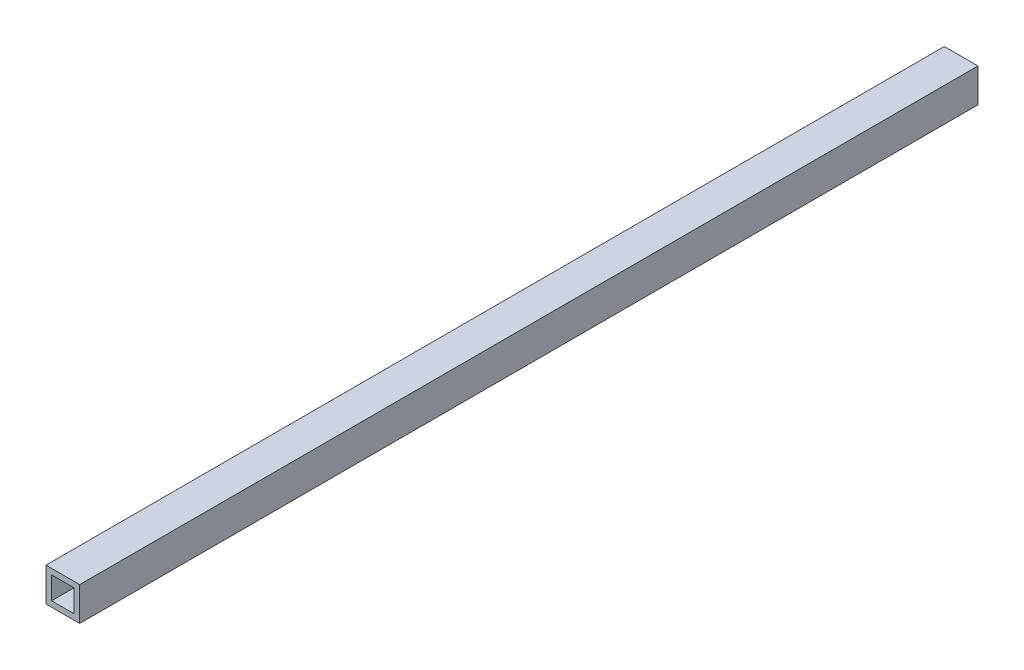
from build123d import *

# Parameters (mm, degrees)
SKETCH1_W           = 19.05
SKETCH1_H           = 19.05
SKETCH1_W_2         = 12.7
SKETCH1_H_2         = 12.7
BOSS_EXTRUDE1_DEPTH = 508
CUT_EXTRUDE1_REACH  = 510.446


with BuildPart() as part:
    # Sketch1 → Boss-Extrude1 (new body)
    with BuildSketch(Plane.XY):
        Rectangle(SKETCH1_W, SKETCH1_H)
        Rectangle(SKETCH1_W_2, SKETCH1_H_2, mode=Mode.SUBTRACT)
    extrude(amount=-BOSS_EXTRUDE1_DEPTH)

    # Sketch2 → Cut-Extrude1 (cut, up to next)
    with BuildSketch(Plane.ZY.offset(9.525), mode=Mode.PRIVATE) as cut_extrude1_sk1:
        with BuildLine():
            Line((-482.6, 3.175), (-152.4, 3.175))
            ThreePointArc((-152.4, 3.175), (-149.225, 0), (-152.4, -3.175))
            Line((-152.4, -3.175), (-482.6, -3.175))
            ThreePointArc((-482.6, -3.175), (-485.775, 0), (-482.6, 3.175))
        make_face()
    cut_extrude1_tool1 = extrude(cut_extrude1_sk1.sketch, amount=-CUT_EXTRUDE1_REACH, mode=Mode.PRIVATE) & part.part
    add(cut_extrude1_tool1.solids().sort_by_distance((-9.525, 0, -317.5))[0], mode=Mode.SUBTRACT)


solid = part.part
